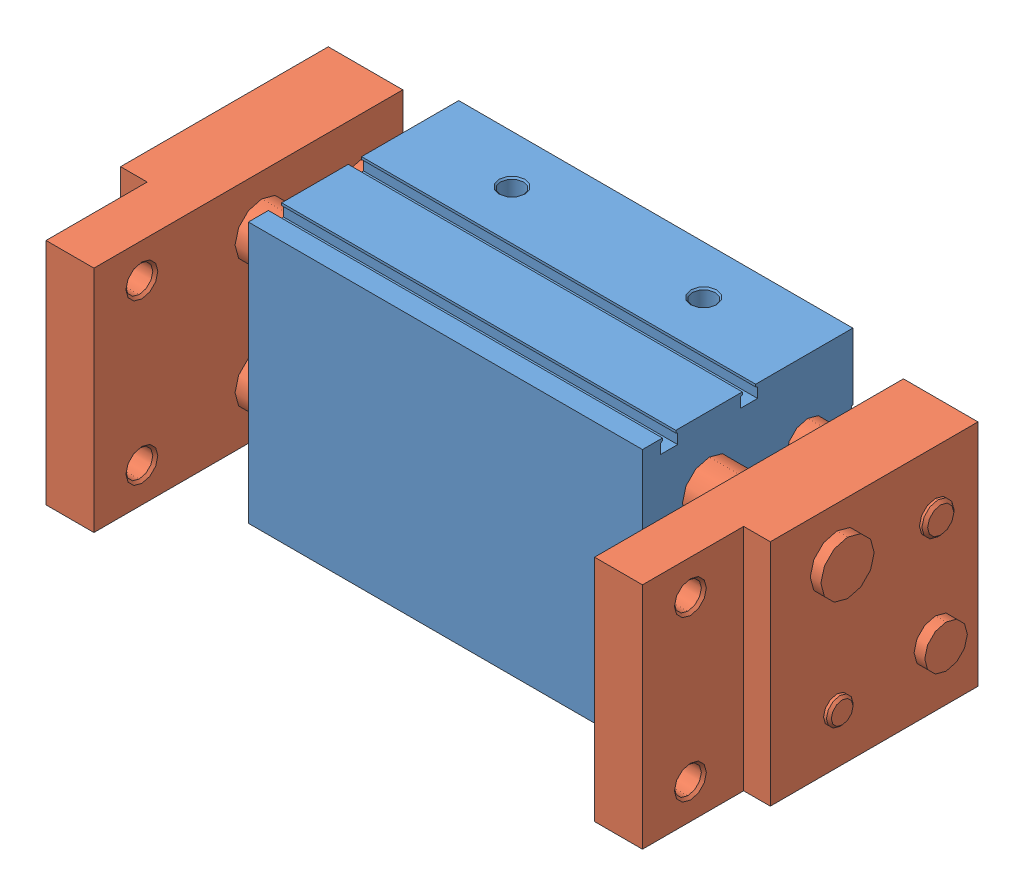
SolidWorks assembly SHL40-100D(188_0).sldasm, configuration Default (file format 11000). Lengths in mm.
Overall size (252 98 117).
3 component instances, 2 part files, 0 mates.
Components (placement in the parent):
- SHL40-100D-A-1: SHL40-100D-A.sldprt [Default] at origin size (153 98 79)
- SHL40-100D-B-1: SHL40-100D-B.sldprt [Default] at (-94 0 0) x (-1 0 0) z (0 0 1) size (250 86 116)
- SHL40-100D-B-2: SHL40-100D-B.sldprt [Default] at (94 0 0) size (250 86 116)
